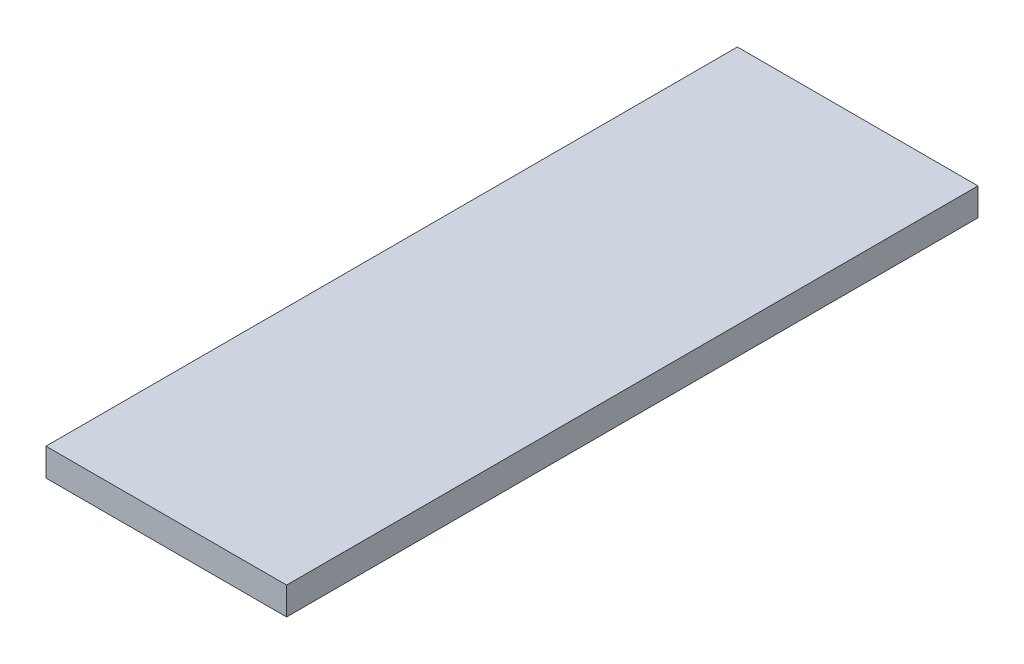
ISO-10303-21;
HEADER;
FILE_DESCRIPTION(('STEP AP214'),'2;1');
FILE_NAME('part.step','',(''),(''),'','','');
FILE_SCHEMA(('AUTOMOTIVE_DESIGN { 1 0 10303 214 1 1 1 1 }'));
ENDSEC;
DATA;
#1=APPLICATION_CONTEXT('core data for automotive mechanical design processes');
#2=APPLICATION_PROTOCOL_DEFINITION('international standard','automotive_design',2000,#1);
#3=PRODUCT_CONTEXT('',#1,'mechanical');
#4=PRODUCT('Part','Part','',(#3));
#5=PRODUCT_RELATED_PRODUCT_CATEGORY('part','',(#4));
#6=PRODUCT_DEFINITION_FORMATION('','',#4);
#7=PRODUCT_DEFINITION_CONTEXT('part definition',#1,'design');
#8=PRODUCT_DEFINITION('design','',#6,#7);
#9=PRODUCT_DEFINITION_SHAPE('','',#8);
#10=(LENGTH_UNIT() NAMED_UNIT(*) SI_UNIT(.MILLI.,.METRE.));
#11=(NAMED_UNIT(*) PLANE_ANGLE_UNIT() SI_UNIT($,.RADIAN.));
#12=(NAMED_UNIT(*) SI_UNIT($,.STERADIAN.) SOLID_ANGLE_UNIT());
#13=UNCERTAINTY_MEASURE_WITH_UNIT(LENGTH_MEASURE(1.E-05),#10,'distance_accuracy_value','');
#14=(GEOMETRIC_REPRESENTATION_CONTEXT(3) GLOBAL_UNCERTAINTY_ASSIGNED_CONTEXT((#13)) GLOBAL_UNIT_ASSIGNED_CONTEXT((#10,
#11,#12)) REPRESENTATION_CONTEXT('',''));
#15=CARTESIAN_POINT('',(0.,0.,0.));
#16=DIRECTION('',(0.,0.,1.));
#17=DIRECTION('',(1.,0.,0.));
#18=AXIS2_PLACEMENT_3D('',#15,#16,#17);
#19=CARTESIAN_POINT('',(-12.9723587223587,1.,15.9103194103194));
#20=DIRECTION('',(1.,0.,0.));
#21=DIRECTION('',(0.,0.,-1.));
#22=AXIS2_PLACEMENT_3D('',#19,#20,#21);
#23=PLANE('',#22);
#24=DIRECTION('',(0.,0.,1.));
#25=VECTOR('',#24,1.);
#26=CARTESIAN_POINT('',(-12.9723587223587,0.,15.9103194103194));
#27=LINE('',#26,#25);
#28=CARTESIAN_POINT('',(-12.9723587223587,0.,-9.08968058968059));
#29=VERTEX_POINT('',#28);
#30=CARTESIAN_POINT('',(-12.9723587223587,0.,15.9103194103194));
#31=VERTEX_POINT('',#30);
#32=EDGE_CURVE('E95',#29,#31,#27,.T.);
#33=ORIENTED_EDGE('',*,*,#32,.T.);
#34=DIRECTION('',(0.,-1.,0.));
#35=VECTOR('',#34,1.);
#36=CARTESIAN_POINT('',(-12.9723587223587,1.,15.9103194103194));
#37=LINE('',#36,#35);
#38=CARTESIAN_POINT('',(-12.9723587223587,1.,15.9103194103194));
#39=VERTEX_POINT('',#38);
#40=EDGE_CURVE('E11',#39,#31,#37,.T.);
#41=ORIENTED_EDGE('',*,*,#40,.F.);
#42=DIRECTION('',(0.,0.,1.));
#43=VECTOR('',#42,1.);
#44=CARTESIAN_POINT('',(-12.9723587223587,1.,15.9103194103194));
#45=LINE('',#44,#43);
#46=CARTESIAN_POINT('',(-12.9723587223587,1.,-9.08968058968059));
#47=VERTEX_POINT('',#46);
#48=EDGE_CURVE('E83',#47,#39,#45,.T.);
#49=ORIENTED_EDGE('',*,*,#48,.F.);
#50=DIRECTION('',(0.,-1.,0.));
#51=VECTOR('',#50,1.);
#52=CARTESIAN_POINT('',(-12.9723587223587,1.,-9.08968058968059));
#53=LINE('',#52,#51);
#54=EDGE_CURVE('E91',#47,#29,#53,.T.);
#55=ORIENTED_EDGE('',*,*,#54,.T.);
#56=EDGE_LOOP('',(#33,#41,#49,#55));
#57=FACE_BOUND('',#56,.T.);
#58=ADVANCED_FACE('F32',(#57),#23,.F.);
#59=CARTESIAN_POINT('',(-12.9723587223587,1.,15.9103194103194));
#60=DIRECTION('',(0.,0.,-1.));
#61=DIRECTION('',(-1.,0.,0.));
#62=AXIS2_PLACEMENT_3D('',#59,#60,#61);
#63=PLANE('',#62);
#64=DIRECTION('',(1.,0.,0.));
#65=VECTOR('',#64,1.);
#66=CARTESIAN_POINT('',(-12.9723587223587,0.,15.9103194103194));
#67=LINE('',#66,#65);
#68=CARTESIAN_POINT('',(-4.27235872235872,0.,15.9103194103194));
#69=VERTEX_POINT('',#68);
#70=EDGE_CURVE('E87',#31,#69,#67,.T.);
#71=ORIENTED_EDGE('',*,*,#70,.T.);
#72=DIRECTION('',(0.,-1.,0.));
#73=VECTOR('',#72,1.);
#74=CARTESIAN_POINT('',(-4.27235872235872,1.,15.9103194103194));
#75=LINE('',#74,#73);
#76=CARTESIAN_POINT('',(-4.27235872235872,1.,15.9103194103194));
#77=VERTEX_POINT('',#76);
#78=EDGE_CURVE('E40',#77,#69,#75,.T.);
#79=ORIENTED_EDGE('',*,*,#78,.F.);
#80=DIRECTION('',(1.,0.,0.));
#81=VECTOR('',#80,1.);
#82=CARTESIAN_POINT('',(-12.9723587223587,1.,15.9103194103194));
#83=LINE('',#82,#81);
#84=EDGE_CURVE('E78',#39,#77,#83,.T.);
#85=ORIENTED_EDGE('',*,*,#84,.F.);
#86=ORIENTED_EDGE('',*,*,#40,.T.);
#87=EDGE_LOOP('',(#71,#79,#85,#86));
#88=FACE_BOUND('',#87,.T.);
#89=ADVANCED_FACE('F86',(#88),#63,.F.);
#90=CARTESIAN_POINT('',(-4.27235872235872,1.,15.9103194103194));
#91=DIRECTION('',(-1.,0.,0.));
#92=DIRECTION('',(0.,0.,1.));
#93=AXIS2_PLACEMENT_3D('',#90,#91,#92);
#94=PLANE('',#93);
#95=DIRECTION('',(0.,0.,-1.));
#96=VECTOR('',#95,1.);
#97=CARTESIAN_POINT('',(-4.27235872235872,0.,15.9103194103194));
#98=LINE('',#97,#96);
#99=CARTESIAN_POINT('',(-4.27235872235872,0.,-9.08968058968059));
#100=VERTEX_POINT('',#99);
#101=EDGE_CURVE('E65',#69,#100,#98,.T.);
#102=ORIENTED_EDGE('',*,*,#101,.T.);
#103=DIRECTION('',(0.,-1.,0.));
#104=VECTOR('',#103,1.);
#105=CARTESIAN_POINT('',(-4.27235872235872,1.,-9.08968058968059));
#106=LINE('',#105,#104);
#107=CARTESIAN_POINT('',(-4.27235872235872,1.,-9.08968058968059));
#108=VERTEX_POINT('',#107);
#109=EDGE_CURVE('E88',#108,#100,#106,.T.);
#110=ORIENTED_EDGE('',*,*,#109,.F.);
#111=DIRECTION('',(0.,0.,-1.));
#112=VECTOR('',#111,1.);
#113=CARTESIAN_POINT('',(-4.27235872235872,1.,15.9103194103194));
#114=LINE('',#113,#112);
#115=EDGE_CURVE('E81',#77,#108,#114,.T.);
#116=ORIENTED_EDGE('',*,*,#115,.F.);
#117=ORIENTED_EDGE('',*,*,#78,.T.);
#118=EDGE_LOOP('',(#102,#110,#116,#117));
#119=FACE_BOUND('',#118,.T.);
#120=ADVANCED_FACE('F89',(#119),#94,.F.);
#121=CARTESIAN_POINT('',(-12.9723587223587,1.,-9.08968058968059));
#122=DIRECTION('',(0.,0.,1.));
#123=DIRECTION('',(1.,0.,0.));
#124=AXIS2_PLACEMENT_3D('',#121,#122,#123);
#125=PLANE('',#124);
#126=DIRECTION('',(-1.,0.,0.));
#127=VECTOR('',#126,1.);
#128=CARTESIAN_POINT('',(-12.9723587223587,0.,-9.08968058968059));
#129=LINE('',#128,#127);
#130=EDGE_CURVE('E71',#100,#29,#129,.T.);
#131=ORIENTED_EDGE('',*,*,#130,.T.);
#132=ORIENTED_EDGE('',*,*,#54,.F.);
#133=DIRECTION('',(-1.,0.,0.));
#134=VECTOR('',#133,1.);
#135=CARTESIAN_POINT('',(-12.9723587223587,1.,-9.08968058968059));
#136=LINE('',#135,#134);
#137=EDGE_CURVE('E48',#108,#47,#136,.T.);
#138=ORIENTED_EDGE('',*,*,#137,.F.);
#139=ORIENTED_EDGE('',*,*,#109,.T.);
#140=EDGE_LOOP('',(#131,#132,#138,#139));
#141=FACE_BOUND('',#140,.T.);
#142=ADVANCED_FACE('F102',(#141),#125,.F.);
#143=CARTESIAN_POINT('',(0.,1.,0.));
#144=DIRECTION('',(0.,-1.,0.));
#145=DIRECTION('',(0.,0.,-1.));
#146=AXIS2_PLACEMENT_3D('',#143,#144,#145);
#147=PLANE('',#146);
#148=ORIENTED_EDGE('',*,*,#48,.T.);
#149=ORIENTED_EDGE('',*,*,#84,.T.);
#150=ORIENTED_EDGE('',*,*,#115,.T.);
#151=ORIENTED_EDGE('',*,*,#137,.T.);
#152=EDGE_LOOP('',(#148,#149,#150,#151));
#153=FACE_BOUND('',#152,.T.);
#154=ADVANCED_FACE('F79',(#153),#147,.F.);
#155=CARTESIAN_POINT('',(0.,0.,0.));
#156=DIRECTION('',(0.,-1.,0.));
#157=DIRECTION('',(0.,0.,-1.));
#158=AXIS2_PLACEMENT_3D('',#155,#156,#157);
#159=PLANE('',#158);
#160=ORIENTED_EDGE('',*,*,#32,.F.);
#161=ORIENTED_EDGE('',*,*,#130,.F.);
#162=ORIENTED_EDGE('',*,*,#101,.F.);
#163=ORIENTED_EDGE('',*,*,#70,.F.);
#164=EDGE_LOOP('',(#160,#161,#162,#163));
#165=FACE_BOUND('',#164,.T.);
#166=ADVANCED_FACE('F105',(#165),#159,.T.);
#167=CLOSED_SHELL('',(#58,#89,#120,#142,#154,#166));
#168=MANIFOLD_SOLID_BREP('B2',#167);
#169=ADVANCED_BREP_SHAPE_REPRESENTATION('',(#18,#168),#14);
#170=SHAPE_DEFINITION_REPRESENTATION(#9,#169);
ENDSEC;
END-ISO-10303-21;
